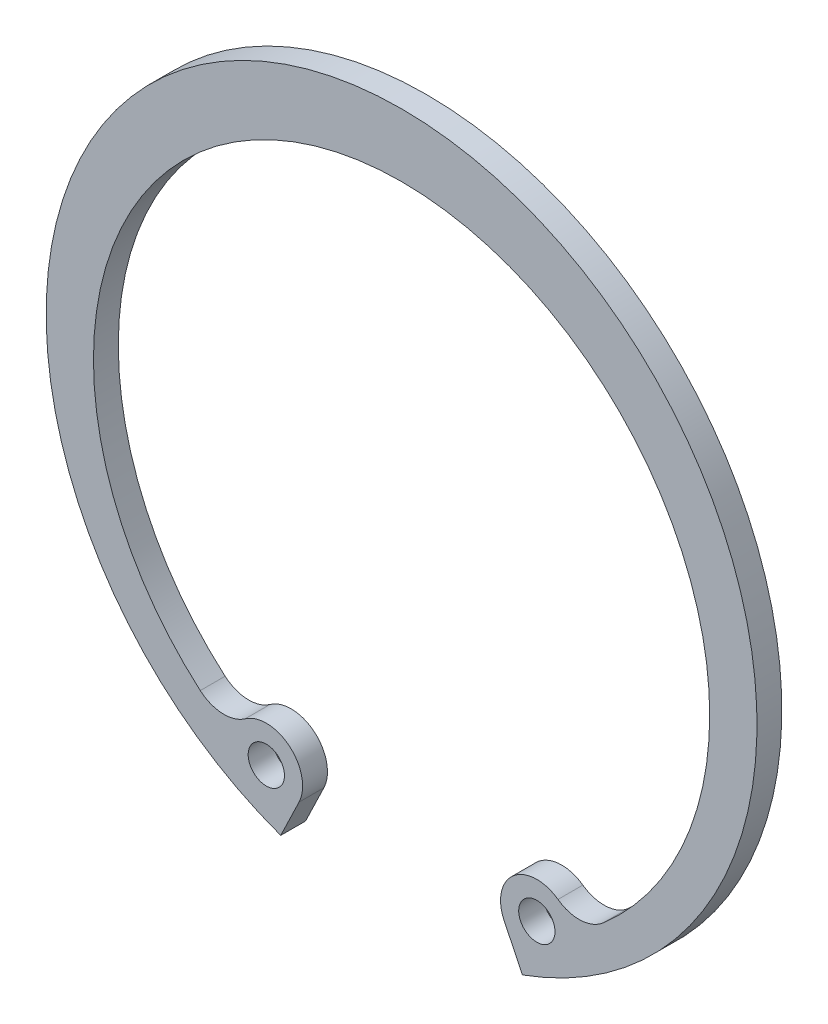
ISO-10303-21;
HEADER;
FILE_DESCRIPTION(('STEP AP214'),'2;1');
FILE_NAME('part.step','',(''),(''),'','','');
FILE_SCHEMA(('AUTOMOTIVE_DESIGN { 1 0 10303 214 1 1 1 1 }'));
ENDSEC;
DATA;
#1=APPLICATION_CONTEXT('core data for automotive mechanical design processes');
#2=APPLICATION_PROTOCOL_DEFINITION('international standard','automotive_design',2000,#1);
#3=PRODUCT_CONTEXT('',#1,'mechanical');
#4=PRODUCT('Part','Part','',(#3));
#5=PRODUCT_RELATED_PRODUCT_CATEGORY('part','',(#4));
#6=PRODUCT_DEFINITION_FORMATION('','',#4);
#7=PRODUCT_DEFINITION_CONTEXT('part definition',#1,'design');
#8=PRODUCT_DEFINITION('design','',#6,#7);
#9=PRODUCT_DEFINITION_SHAPE('','',#8);
#10=(LENGTH_UNIT() NAMED_UNIT(*) SI_UNIT(.MILLI.,.METRE.));
#11=(NAMED_UNIT(*) PLANE_ANGLE_UNIT() SI_UNIT($,.RADIAN.));
#12=(NAMED_UNIT(*) SI_UNIT($,.STERADIAN.) SOLID_ANGLE_UNIT());
#13=UNCERTAINTY_MEASURE_WITH_UNIT(LENGTH_MEASURE(1.E-05),#10,'distance_accuracy_value','');
#14=(GEOMETRIC_REPRESENTATION_CONTEXT(3) GLOBAL_UNCERTAINTY_ASSIGNED_CONTEXT((#13)) GLOBAL_UNIT_ASSIGNED_CONTEXT((#10,
#11,#12)) REPRESENTATION_CONTEXT('',''));
#15=CARTESIAN_POINT('',(0.,0.,0.));
#16=DIRECTION('',(0.,0.,1.));
#17=DIRECTION('',(1.,0.,0.));
#18=AXIS2_PLACEMENT_3D('',#15,#16,#17);
#19=CARTESIAN_POINT('',(-0.048039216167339,-16.8767651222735,0.));
#20=DIRECTION('',(0.,0.,1.));
#21=DIRECTION('',(1.,0.,0.));
#22=AXIS2_PLACEMENT_3D('',#19,#20,#21);
#23=PLANE('',#22);
#24=CARTESIAN_POINT('',(-7.07886844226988,-31.6826299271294,0.));
#25=DIRECTION('',(0.,0.,1.));
#26=DIRECTION('',(1.,0.,0.));
#27=AXIS2_PLACEMENT_3D('',#24,#25,#26);
#28=CIRCLE('',#27,0.95);
#29=CARTESIAN_POINT('',(-6.12886844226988,-31.6826299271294,0.));
#30=VERTEX_POINT('',#29);
#31=EDGE_CURVE('E130',#30,#30,#28,.T.);
#32=ORIENTED_EDGE('',*,*,#31,.T.);
#33=EDGE_LOOP('',(#32));
#34=FACE_BOUND('',#33,.T.);
#35=CARTESIAN_POINT('',(7.07886844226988,-31.6826299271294,0.));
#36=DIRECTION('',(0.,0.,1.));
#37=DIRECTION('',(1.,0.,0.));
#38=AXIS2_PLACEMENT_3D('',#35,#36,#37);
#39=CIRCLE('',#38,0.95);
#40=CARTESIAN_POINT('',(8.02886844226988,-31.6826299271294,0.));
#41=VERTEX_POINT('',#40);
#42=EDGE_CURVE('E133',#41,#41,#39,.T.);
#43=ORIENTED_EDGE('',*,*,#42,.T.);
#44=EDGE_LOOP('',(#43));
#45=FACE_BOUND('',#44,.T.);
#46=CARTESIAN_POINT('',(-9.29336421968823,-28.5945871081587,0.));
#47=DIRECTION('',(0.,0.,1.));
#48=DIRECTION('',(1.,0.,0.));
#49=AXIS2_PLACEMENT_3D('',#46,#47,#48);
#50=CIRCLE('',#49,1.9);
#51=CARTESIAN_POINT('',(-10.5346571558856,-30.0330556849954,0.));
#52=VERTEX_POINT('',#51);
#53=CARTESIAN_POINT('',(-8.18611633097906,-30.1386085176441,0.));
#54=VERTEX_POINT('',#53);
#55=EDGE_CURVE('E136',#52,#54,#50,.T.);
#56=ORIENTED_EDGE('',*,*,#55,.T.);
#57=CARTESIAN_POINT('',(-7.07886844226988,-31.6826299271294,0.));
#58=DIRECTION('',(0.,0.,1.));
#59=DIRECTION('',(1.,0.,0.));
#60=AXIS2_PLACEMENT_3D('',#57,#58,#59);
#61=CIRCLE('',#60,1.9);
#62=CARTESIAN_POINT('',(-5.36739624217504,-32.5077741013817,0.));
#63=VERTEX_POINT('',#62);
#64=EDGE_CURVE('E138',#63,#54,#61,.T.);
#65=ORIENTED_EDGE('',*,*,#64,.F.);
#66=DIRECTION('',(0.43428640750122,0.900774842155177,0.));
#67=VECTOR('',#66,1.);
#68=CARTESIAN_POINT('',(-5.36739624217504,-32.5077741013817,0.));
#69=LINE('',#68,#67);
#70=CARTESIAN_POINT('',(-6.324,-34.491913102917,0.));
#71=VERTEX_POINT('',#70);
#72=EDGE_CURVE('E103',#71,#63,#69,.T.);
#73=ORIENTED_EDGE('',*,*,#72,.F.);
#74=CARTESIAN_POINT('',(0.,-17.,0.));
#75=DIRECTION('',(0.,0.,1.));
#76=DIRECTION('',(1.,0.,0.));
#77=AXIS2_PLACEMENT_3D('',#74,#75,#76);
#78=CIRCLE('',#77,18.6);
#79=CARTESIAN_POINT('',(6.324,-34.491913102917,0.));
#80=VERTEX_POINT('',#79);
#81=EDGE_CURVE('E140',#80,#71,#78,.T.);
#82=ORIENTED_EDGE('',*,*,#81,.F.);
#83=DIRECTION('',(0.43428640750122,-0.900774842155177,0.));
#84=VECTOR('',#83,1.);
#85=CARTESIAN_POINT('',(6.324,-34.491913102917,0.));
#86=LINE('',#85,#84);
#87=CARTESIAN_POINT('',(5.36739624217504,-32.5077741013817,0.));
#88=VERTEX_POINT('',#87);
#89=EDGE_CURVE('E107',#88,#80,#86,.T.);
#90=ORIENTED_EDGE('',*,*,#89,.F.);
#91=CARTESIAN_POINT('',(7.07886844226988,-31.6826299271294,0.));
#92=DIRECTION('',(0.,0.,1.));
#93=DIRECTION('',(1.,0.,0.));
#94=AXIS2_PLACEMENT_3D('',#91,#92,#93);
#95=CIRCLE('',#94,1.9);
#96=CARTESIAN_POINT('',(8.18611633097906,-30.1386085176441,0.));
#97=VERTEX_POINT('',#96);
#98=EDGE_CURVE('E83',#97,#88,#95,.T.);
#99=ORIENTED_EDGE('',*,*,#98,.F.);
#100=CARTESIAN_POINT('',(9.29336421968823,-28.5945871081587,0.));
#101=DIRECTION('',(0.,0.,1.));
#102=DIRECTION('',(1.,0.,0.));
#103=AXIS2_PLACEMENT_3D('',#100,#101,#102);
#104=CIRCLE('',#103,1.9);
#105=CARTESIAN_POINT('',(10.5346571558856,-30.0330556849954,0.));
#106=VERTEX_POINT('',#105);
#107=EDGE_CURVE('E79',#97,#106,#104,.T.);
#108=ORIENTED_EDGE('',*,*,#107,.T.);
#109=CARTESIAN_POINT('',(0.,-17.825,0.));
#110=DIRECTION('',(0.,0.,1.));
#111=DIRECTION('',(1.,0.,0.));
#112=AXIS2_PLACEMENT_3D('',#109,#110,#111);
#113=CIRCLE('',#112,16.125);
#114=EDGE_CURVE('E19',#106,#52,#113,.T.);
#115=ORIENTED_EDGE('',*,*,#114,.T.);
#116=EDGE_LOOP('',(#56,#65,#73,#82,#90,#99,#108,#115));
#117=FACE_BOUND('',#116,.T.);
#118=ADVANCED_FACE('F16',(#34,#45,#117),#23,.F.);
#119=CARTESIAN_POINT('',(0.,-17.825,0.));
#120=DIRECTION('',(0.,0.,1.));
#121=DIRECTION('',(1.,0.,0.));
#122=AXIS2_PLACEMENT_3D('',#119,#120,#121);
#123=CYLINDRICAL_SURFACE('',#122,16.125);
#124=DIRECTION('',(0.,0.,1.));
#125=VECTOR('',#124,1.);
#126=CARTESIAN_POINT('',(-10.5346571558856,-30.0330556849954,0.));
#127=LINE('',#126,#125);
#128=CARTESIAN_POINT('',(-10.5346571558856,-30.0330556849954,1.3));
#129=VERTEX_POINT('',#128);
#130=EDGE_CURVE('E92',#129,#52,#127,.F.);
#131=ORIENTED_EDGE('',*,*,#130,.T.);
#132=ORIENTED_EDGE('',*,*,#114,.F.);
#133=DIRECTION('',(0.,0.,1.));
#134=VECTOR('',#133,1.);
#135=CARTESIAN_POINT('',(10.5346571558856,-30.0330556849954,0.));
#136=LINE('',#135,#134);
#137=CARTESIAN_POINT('',(10.5346571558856,-30.0330556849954,1.3));
#138=VERTEX_POINT('',#137);
#139=EDGE_CURVE('E87',#106,#138,#136,.T.);
#140=ORIENTED_EDGE('',*,*,#139,.T.);
#141=CARTESIAN_POINT('',(0.,-17.825,1.3));
#142=DIRECTION('',(0.,0.,1.));
#143=DIRECTION('',(1.,0.,0.));
#144=AXIS2_PLACEMENT_3D('',#141,#142,#143);
#145=CIRCLE('',#144,16.125);
#146=EDGE_CURVE('E128',#129,#138,#145,.F.);
#147=ORIENTED_EDGE('',*,*,#146,.F.);
#148=EDGE_LOOP('',(#131,#132,#140,#147));
#149=FACE_BOUND('',#148,.T.);
#150=ADVANCED_FACE('F89',(#149),#123,.F.);
#151=CARTESIAN_POINT('',(9.29336421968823,-28.5945871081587,0.));
#152=DIRECTION('',(0.,0.,1.));
#153=DIRECTION('',(1.,0.,0.));
#154=AXIS2_PLACEMENT_3D('',#151,#152,#153);
#155=CYLINDRICAL_SURFACE('',#154,1.9);
#156=ORIENTED_EDGE('',*,*,#139,.F.);
#157=ORIENTED_EDGE('',*,*,#107,.F.);
#158=DIRECTION('',(0.,0.,1.));
#159=VECTOR('',#158,1.);
#160=CARTESIAN_POINT('',(8.18611633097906,-30.1386085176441,0.));
#161=LINE('',#160,#159);
#162=CARTESIAN_POINT('',(8.18611633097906,-30.1386085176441,1.3));
#163=VERTEX_POINT('',#162);
#164=EDGE_CURVE('E98',#163,#97,#161,.F.);
#165=ORIENTED_EDGE('',*,*,#164,.F.);
#166=CARTESIAN_POINT('',(9.29336421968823,-28.5945871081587,1.3));
#167=DIRECTION('',(0.,0.,1.));
#168=DIRECTION('',(1.,0.,0.));
#169=AXIS2_PLACEMENT_3D('',#166,#167,#168);
#170=CIRCLE('',#169,1.9);
#171=EDGE_CURVE('E96',#138,#163,#170,.F.);
#172=ORIENTED_EDGE('',*,*,#171,.F.);
#173=EDGE_LOOP('',(#156,#157,#165,#172));
#174=FACE_BOUND('',#173,.T.);
#175=ADVANCED_FACE('F94',(#174),#155,.F.);
#176=CARTESIAN_POINT('',(7.07886844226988,-31.6826299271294,0.));
#177=DIRECTION('',(0.,0.,1.));
#178=DIRECTION('',(1.,0.,0.));
#179=AXIS2_PLACEMENT_3D('',#176,#177,#178);
#180=CYLINDRICAL_SURFACE('',#179,1.9);
#181=ORIENTED_EDGE('',*,*,#98,.T.);
#182=DIRECTION('',(0.,0.,1.));
#183=VECTOR('',#182,1.);
#184=CARTESIAN_POINT('',(5.36739624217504,-32.5077741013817,0.));
#185=LINE('',#184,#183);
#186=CARTESIAN_POINT('',(5.36739624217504,-32.5077741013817,1.3));
#187=VERTEX_POINT('',#186);
#188=EDGE_CURVE('E109',#187,#88,#185,.F.);
#189=ORIENTED_EDGE('',*,*,#188,.F.);
#190=CARTESIAN_POINT('',(7.07886844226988,-31.6826299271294,1.3));
#191=DIRECTION('',(0.,0.,1.));
#192=DIRECTION('',(1.,0.,0.));
#193=AXIS2_PLACEMENT_3D('',#190,#191,#192);
#194=CIRCLE('',#193,1.9);
#195=EDGE_CURVE('E124',#163,#187,#194,.T.);
#196=ORIENTED_EDGE('',*,*,#195,.F.);
#197=ORIENTED_EDGE('',*,*,#164,.T.);
#198=EDGE_LOOP('',(#181,#189,#196,#197));
#199=FACE_BOUND('',#198,.T.);
#200=ADVANCED_FACE('F210',(#199),#180,.T.);
#201=CARTESIAN_POINT('',(6.324,-34.491913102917,0.));
#202=DIRECTION('',(-0.900774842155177,-0.43428640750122,0.));
#203=DIRECTION('',(0.43428640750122,-0.900774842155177,0.));
#204=AXIS2_PLACEMENT_3D('',#201,#202,#203);
#205=PLANE('',#204);
#206=ORIENTED_EDGE('',*,*,#89,.T.);
#207=DIRECTION('',(0.,0.,1.));
#208=VECTOR('',#207,1.);
#209=CARTESIAN_POINT('',(6.324,-34.491913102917,0.));
#210=LINE('',#209,#208);
#211=CARTESIAN_POINT('',(6.324,-34.491913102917,1.3));
#212=VERTEX_POINT('',#211);
#213=EDGE_CURVE('E108',#212,#80,#210,.F.);
#214=ORIENTED_EDGE('',*,*,#213,.F.);
#215=DIRECTION('',(0.434286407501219,-0.900774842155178,0.));
#216=VECTOR('',#215,1.);
#217=CARTESIAN_POINT('',(5.36739624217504,-32.5077741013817,1.3));
#218=LINE('',#217,#216);
#219=EDGE_CURVE('E123',#187,#212,#218,.T.);
#220=ORIENTED_EDGE('',*,*,#219,.F.);
#221=ORIENTED_EDGE('',*,*,#188,.T.);
#222=EDGE_LOOP('',(#206,#214,#220,#221));
#223=FACE_BOUND('',#222,.T.);
#224=ADVANCED_FACE('F215',(#223),#205,.T.);
#225=CARTESIAN_POINT('',(0.,-17.,0.));
#226=DIRECTION('',(0.,0.,1.));
#227=DIRECTION('',(1.,0.,0.));
#228=AXIS2_PLACEMENT_3D('',#225,#226,#227);
#229=CYLINDRICAL_SURFACE('',#228,18.6);
#230=ORIENTED_EDGE('',*,*,#81,.T.);
#231=DIRECTION('',(0.,0.,1.));
#232=VECTOR('',#231,1.);
#233=CARTESIAN_POINT('',(-6.32400000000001,-34.491913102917,0.));
#234=LINE('',#233,#232);
#235=CARTESIAN_POINT('',(-6.324,-34.491913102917,1.3));
#236=VERTEX_POINT('',#235);
#237=EDGE_CURVE('E106',#236,#71,#234,.F.);
#238=ORIENTED_EDGE('',*,*,#237,.F.);
#239=CARTESIAN_POINT('',(0.,-17.,1.3));
#240=DIRECTION('',(0.,0.,1.));
#241=DIRECTION('',(1.,0.,0.));
#242=AXIS2_PLACEMENT_3D('',#239,#240,#241);
#243=CIRCLE('',#242,18.6);
#244=EDGE_CURVE('E120',#212,#236,#243,.T.);
#245=ORIENTED_EDGE('',*,*,#244,.F.);
#246=ORIENTED_EDGE('',*,*,#213,.T.);
#247=EDGE_LOOP('',(#230,#238,#245,#246));
#248=FACE_BOUND('',#247,.T.);
#249=ADVANCED_FACE('F178',(#248),#229,.T.);
#250=CARTESIAN_POINT('',(-5.36739624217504,-32.5077741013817,0.));
#251=DIRECTION('',(0.900774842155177,-0.43428640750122,0.));
#252=DIRECTION('',(0.43428640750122,0.900774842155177,0.));
#253=AXIS2_PLACEMENT_3D('',#250,#251,#252);
#254=PLANE('',#253);
#255=ORIENTED_EDGE('',*,*,#72,.T.);
#256=DIRECTION('',(0.,0.,1.));
#257=VECTOR('',#256,1.);
#258=CARTESIAN_POINT('',(-5.36739624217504,-32.5077741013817,0.));
#259=LINE('',#258,#257);
#260=CARTESIAN_POINT('',(-5.36739624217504,-32.5077741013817,1.3));
#261=VERTEX_POINT('',#260);
#262=EDGE_CURVE('E105',#261,#63,#259,.F.);
#263=ORIENTED_EDGE('',*,*,#262,.F.);
#264=DIRECTION('',(0.434286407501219,0.900774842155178,0.));
#265=VECTOR('',#264,1.);
#266=CARTESIAN_POINT('',(-6.324,-34.491913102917,1.3));
#267=LINE('',#266,#265);
#268=EDGE_CURVE('E119',#236,#261,#267,.T.);
#269=ORIENTED_EDGE('',*,*,#268,.F.);
#270=ORIENTED_EDGE('',*,*,#237,.T.);
#271=EDGE_LOOP('',(#255,#263,#269,#270));
#272=FACE_BOUND('',#271,.T.);
#273=ADVANCED_FACE('F163',(#272),#254,.T.);
#274=CARTESIAN_POINT('',(-7.07886844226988,-31.6826299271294,0.));
#275=DIRECTION('',(0.,0.,1.));
#276=DIRECTION('',(1.,0.,0.));
#277=AXIS2_PLACEMENT_3D('',#274,#275,#276);
#278=CYLINDRICAL_SURFACE('',#277,1.9);
#279=ORIENTED_EDGE('',*,*,#64,.T.);
#280=DIRECTION('',(0.,0.,1.));
#281=VECTOR('',#280,1.);
#282=CARTESIAN_POINT('',(-8.18611633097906,-30.1386085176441,0.));
#283=LINE('',#282,#281);
#284=CARTESIAN_POINT('',(-8.18611633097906,-30.1386085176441,1.3));
#285=VERTEX_POINT('',#284);
#286=EDGE_CURVE('E34',#54,#285,#283,.T.);
#287=ORIENTED_EDGE('',*,*,#286,.T.);
#288=CARTESIAN_POINT('',(-7.07886844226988,-31.6826299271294,1.3));
#289=DIRECTION('',(0.,0.,1.));
#290=DIRECTION('',(1.,0.,0.));
#291=AXIS2_PLACEMENT_3D('',#288,#289,#290);
#292=CIRCLE('',#291,1.9);
#293=EDGE_CURVE('E116',#261,#285,#292,.T.);
#294=ORIENTED_EDGE('',*,*,#293,.F.);
#295=ORIENTED_EDGE('',*,*,#262,.T.);
#296=EDGE_LOOP('',(#279,#287,#294,#295));
#297=FACE_BOUND('',#296,.T.);
#298=ADVANCED_FACE('F166',(#297),#278,.T.);
#299=CARTESIAN_POINT('',(-9.29336421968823,-28.5945871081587,0.));
#300=DIRECTION('',(0.,0.,1.));
#301=DIRECTION('',(1.,0.,0.));
#302=AXIS2_PLACEMENT_3D('',#299,#300,#301);
#303=CYLINDRICAL_SURFACE('',#302,1.9);
#304=ORIENTED_EDGE('',*,*,#286,.F.);
#305=ORIENTED_EDGE('',*,*,#55,.F.);
#306=ORIENTED_EDGE('',*,*,#130,.F.);
#307=CARTESIAN_POINT('',(-9.29336421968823,-28.5945871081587,1.3));
#308=DIRECTION('',(0.,0.,1.));
#309=DIRECTION('',(1.,0.,0.));
#310=AXIS2_PLACEMENT_3D('',#307,#308,#309);
#311=CIRCLE('',#310,1.9);
#312=EDGE_CURVE('E113',#285,#129,#311,.F.);
#313=ORIENTED_EDGE('',*,*,#312,.F.);
#314=EDGE_LOOP('',(#304,#305,#306,#313));
#315=FACE_BOUND('',#314,.T.);
#316=ADVANCED_FACE('F168',(#315),#303,.F.);
#317=CARTESIAN_POINT('',(7.07886844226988,-31.6826299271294,0.));
#318=DIRECTION('',(0.,0.,1.));
#319=DIRECTION('',(1.,0.,0.));
#320=AXIS2_PLACEMENT_3D('',#317,#318,#319);
#321=CYLINDRICAL_SURFACE('',#320,0.95);
#322=ORIENTED_EDGE('',*,*,#42,.F.);
#323=EDGE_LOOP('',(#322));
#324=FACE_BOUND('',#323,.T.);
#325=CARTESIAN_POINT('',(7.07886844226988,-31.6826299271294,1.3));
#326=DIRECTION('',(0.,0.,1.));
#327=DIRECTION('',(1.,0.,0.));
#328=AXIS2_PLACEMENT_3D('',#325,#326,#327);
#329=CIRCLE('',#328,0.95);
#330=CARTESIAN_POINT('',(8.02886844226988,-31.6826299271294,1.3));
#331=VERTEX_POINT('',#330);
#332=EDGE_CURVE('E25',#331,#331,#329,.F.);
#333=ORIENTED_EDGE('',*,*,#332,.F.);
#334=EDGE_LOOP('',(#333));
#335=FACE_BOUND('',#334,.T.);
#336=ADVANCED_FACE('F175',(#324,#335),#321,.F.);
#337=CARTESIAN_POINT('',(-7.07886844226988,-31.6826299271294,0.));
#338=DIRECTION('',(0.,0.,1.));
#339=DIRECTION('',(1.,0.,0.));
#340=AXIS2_PLACEMENT_3D('',#337,#338,#339);
#341=CYLINDRICAL_SURFACE('',#340,0.95);
#342=ORIENTED_EDGE('',*,*,#31,.F.);
#343=EDGE_LOOP('',(#342));
#344=FACE_BOUND('',#343,.T.);
#345=CARTESIAN_POINT('',(-7.07886844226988,-31.6826299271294,1.3));
#346=DIRECTION('',(0.,0.,1.));
#347=DIRECTION('',(1.,0.,0.));
#348=AXIS2_PLACEMENT_3D('',#345,#346,#347);
#349=CIRCLE('',#348,0.95);
#350=CARTESIAN_POINT('',(-6.12886844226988,-31.6826299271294,1.3));
#351=VERTEX_POINT('',#350);
#352=EDGE_CURVE('E10',#351,#351,#349,.F.);
#353=ORIENTED_EDGE('',*,*,#352,.F.);
#354=EDGE_LOOP('',(#353));
#355=FACE_BOUND('',#354,.T.);
#356=ADVANCED_FACE('F181',(#344,#355),#341,.F.);
#357=CARTESIAN_POINT('',(-0.048039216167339,-16.8767651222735,1.3));
#358=DIRECTION('',(0.,0.,1.));
#359=DIRECTION('',(1.,0.,0.));
#360=AXIS2_PLACEMENT_3D('',#357,#358,#359);
#361=PLANE('',#360);
#362=ORIENTED_EDGE('',*,*,#352,.T.);
#363=EDGE_LOOP('',(#362));
#364=FACE_BOUND('',#363,.T.);
#365=ORIENTED_EDGE('',*,*,#332,.T.);
#366=EDGE_LOOP('',(#365));
#367=FACE_BOUND('',#366,.T.);
#368=ORIENTED_EDGE('',*,*,#293,.T.);
#369=ORIENTED_EDGE('',*,*,#312,.T.);
#370=ORIENTED_EDGE('',*,*,#146,.T.);
#371=ORIENTED_EDGE('',*,*,#171,.T.);
#372=ORIENTED_EDGE('',*,*,#195,.T.);
#373=ORIENTED_EDGE('',*,*,#219,.T.);
#374=ORIENTED_EDGE('',*,*,#244,.T.);
#375=ORIENTED_EDGE('',*,*,#268,.T.);
#376=EDGE_LOOP('',(#368,#369,#370,#371,#372,#373,#374,#375));
#377=FACE_BOUND('',#376,.T.);
#378=ADVANCED_FACE('F160',(#364,#367,#377),#361,.T.);
#379=CLOSED_SHELL('',(#118,#150,#175,#200,#224,#249,#273,#298,#316,#336,#356,#378));
#380=MANIFOLD_SOLID_BREP('B1',#379);
#381=ADVANCED_BREP_SHAPE_REPRESENTATION('',(#18,#380),#14);
#382=SHAPE_DEFINITION_REPRESENTATION(#9,#381);
ENDSEC;
END-ISO-10303-21;
